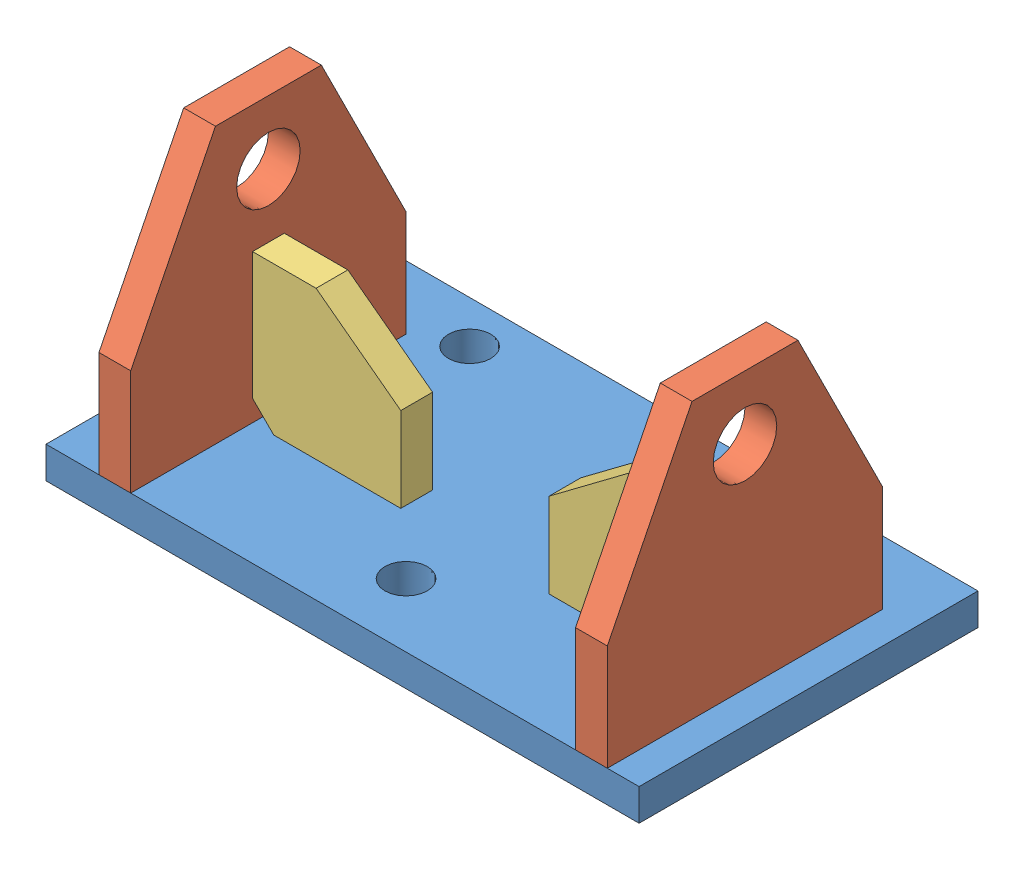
SolidWorks assembly component line font.SLDASM, configuration Default (file format 3100). Lengths in mm.
Overall size (177.8 92.08 101.6).
5 component instances, 3 part files, 12 mates.
Components (placement in the parent):
- RectBase-1: RectBase.SLDPRT [Default] at origin size (177.8 9.53 101.6)
- EndConnect-1: EndConnect.SLDPRT [Default] at (-63.5 9.525 9.525) x (0 0 1) z (-1 0 0) size (82.55 82.55 9.53)
- EndConnect-2: EndConnect.SLDPRT [Default] at (79.375 9.525 9.525) x (0 0 1) z (-1 0 0) size (82.55 82.55 9.53)
- Brace-1: Brace.SLDPRT [Default] at (-63.5 9.525 9.525) x (1 0 0) z (0 -1 0) size (44.45 9.53 44.45)
- Brace-2: Brace.SLDPRT [Default] at (69.85 9.525 9.525) x (-1 0 0) z (0 -1 0) size (44.45 9.53 44.45)
Mates (geometry in assembly coordinates):
- Coincident1: coincident aligned: plane of RectBase-1; plane of EndConnect-1
- Coincident2: coincident anti-aligned: plane of RectBase-1; plane of EndConnect-1
- Coincident3: coincident anti-aligned: plane of RectBase-1; plane of EndConnect-2
- Coincident4: coincident aligned: plane of RectBase-1; plane of EndConnect-2
- Distance1: distance = 9.525 mm aligned: plane of RectBase-1; plane of EndConnect-2
- Distance2: distance = 133.35 mm anti-aligned: plane of EndConnect-1; plane of EndConnect-2
- Coincident5: coincident anti-aligned: plane of RectBase-1; plane of Brace-1
- Coincident6: coincident anti-aligned: plane of EndConnect-1; plane of Brace-1
- Coincident7: coincident anti-aligned: plane of RectBase-1; plane of Brace-2
- Coincident10: coincident anti-aligned: plane of EndConnect-2; plane of Brace-2
- Coincident11: coincident aligned: plane of EndConnect-1; plane of Brace-1
- Coincident12: coincident aligned: plane of Brace-1; plane of Brace-2
